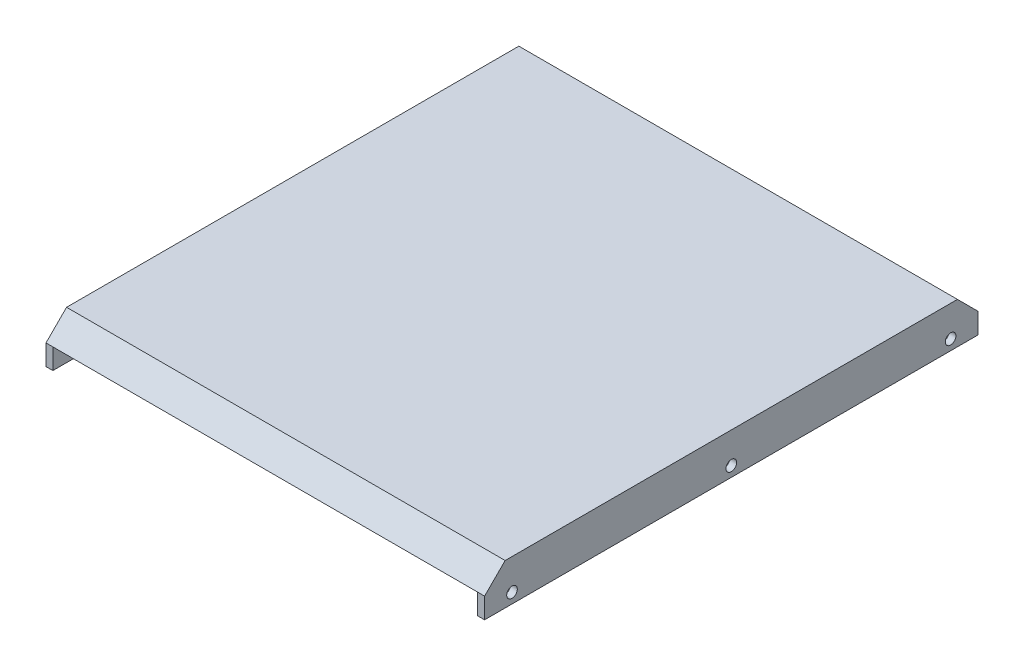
ISO-10303-21;
HEADER;
FILE_DESCRIPTION(('STEP AP214'),'2;1');
FILE_NAME('part.step','',(''),(''),'','','');
FILE_SCHEMA(('AUTOMOTIVE_DESIGN { 1 0 10303 214 1 1 1 1 }'));
ENDSEC;
DATA;
#1=APPLICATION_CONTEXT('core data for automotive mechanical design processes');
#2=APPLICATION_PROTOCOL_DEFINITION('international standard','automotive_design',2000,#1);
#3=PRODUCT_CONTEXT('',#1,'mechanical');
#4=PRODUCT('Part','Part','',(#3));
#5=PRODUCT_RELATED_PRODUCT_CATEGORY('part','',(#4));
#6=PRODUCT_DEFINITION_FORMATION('','',#4);
#7=PRODUCT_DEFINITION_CONTEXT('part definition',#1,'design');
#8=PRODUCT_DEFINITION('design','',#6,#7);
#9=PRODUCT_DEFINITION_SHAPE('','',#8);
#10=(LENGTH_UNIT() NAMED_UNIT(*) SI_UNIT(.MILLI.,.METRE.));
#11=(NAMED_UNIT(*) PLANE_ANGLE_UNIT() SI_UNIT($,.RADIAN.));
#12=(NAMED_UNIT(*) SI_UNIT($,.STERADIAN.) SOLID_ANGLE_UNIT());
#13=UNCERTAINTY_MEASURE_WITH_UNIT(LENGTH_MEASURE(1.E-05),#10,'distance_accuracy_value','');
#14=(GEOMETRIC_REPRESENTATION_CONTEXT(3) GLOBAL_UNCERTAINTY_ASSIGNED_CONTEXT((#13)) GLOBAL_UNIT_ASSIGNED_CONTEXT((#10,
#11,#12)) REPRESENTATION_CONTEXT('',''));
#15=CARTESIAN_POINT('',(0.,0.,0.));
#16=DIRECTION('',(0.,0.,1.));
#17=DIRECTION('',(1.,0.,0.));
#18=AXIS2_PLACEMENT_3D('',#15,#16,#17);
#19=CARTESIAN_POINT('',(0.,0.,-114.3));
#20=DIRECTION('',(0.,0.,1.));
#21=DIRECTION('',(1.,0.,0.));
#22=AXIS2_PLACEMENT_3D('',#19,#20,#21);
#23=PLANE('',#22);
#24=DIRECTION('',(0.,-1.,0.));
#25=VECTOR('',#24,1.);
#26=CARTESIAN_POINT('',(-101.6,9.525,-114.3));
#27=LINE('',#26,#25);
#28=CARTESIAN_POINT('',(-101.6,0.,-114.3));
#29=VERTEX_POINT('',#28);
#30=CARTESIAN_POINT('',(-101.6,-9.525,-114.3));
#31=VERTEX_POINT('',#30);
#32=EDGE_CURVE('E146',#29,#31,#27,.T.);
#33=ORIENTED_EDGE('',*,*,#32,.F.);
#34=DIRECTION('',(1.,0.,0.));
#35=VECTOR('',#34,1.);
#36=CARTESIAN_POINT('',(0.,0.,-114.3));
#37=LINE('',#36,#35);
#38=CARTESIAN_POINT('',(-98.425,0.,-114.3));
#39=VERTEX_POINT('',#38);
#40=EDGE_CURVE('E11',#29,#39,#37,.T.);
#41=ORIENTED_EDGE('',*,*,#40,.T.);
#42=DIRECTION('',(0.,-1.,0.));
#43=VECTOR('',#42,1.);
#44=CARTESIAN_POINT('',(-98.425,-9.525,-114.3));
#45=LINE('',#44,#43);
#46=CARTESIAN_POINT('',(-98.425,-9.525,-114.3));
#47=VERTEX_POINT('',#46);
#48=EDGE_CURVE('E116',#39,#47,#45,.T.);
#49=ORIENTED_EDGE('',*,*,#48,.T.);
#50=DIRECTION('',(1.,0.,0.));
#51=VECTOR('',#50,1.);
#52=CARTESIAN_POINT('',(-101.6,-9.525,-114.3));
#53=LINE('',#52,#51);
#54=EDGE_CURVE('E130',#31,#47,#53,.T.);
#55=ORIENTED_EDGE('',*,*,#54,.F.);
#56=EDGE_LOOP('',(#33,#41,#49,#55));
#57=FACE_BOUND('',#56,.T.);
#58=ADVANCED_FACE('F35',(#57),#23,.F.);
#59=CARTESIAN_POINT('',(0.,0.,114.3));
#60=DIRECTION('',(0.,0.,1.));
#61=DIRECTION('',(1.,0.,0.));
#62=AXIS2_PLACEMENT_3D('',#59,#60,#61);
#63=PLANE('',#62);
#64=DIRECTION('',(0.,1.,0.));
#65=VECTOR('',#64,1.);
#66=CARTESIAN_POINT('',(101.6,9.525,114.3));
#67=LINE('',#66,#65);
#68=CARTESIAN_POINT('',(101.6,-9.525,114.3));
#69=VERTEX_POINT('',#68);
#70=CARTESIAN_POINT('',(101.6,0.,114.3));
#71=VERTEX_POINT('',#70);
#72=EDGE_CURVE('E140',#69,#71,#67,.T.);
#73=ORIENTED_EDGE('',*,*,#72,.T.);
#74=DIRECTION('',(-1.,0.,0.));
#75=VECTOR('',#74,1.);
#76=CARTESIAN_POINT('',(-101.6,0.,114.3));
#77=LINE('',#76,#75);
#78=CARTESIAN_POINT('',(98.425,0.,114.3));
#79=VERTEX_POINT('',#78);
#80=EDGE_CURVE('E167',#71,#79,#77,.T.);
#81=ORIENTED_EDGE('',*,*,#80,.T.);
#82=DIRECTION('',(0.,1.,0.));
#83=VECTOR('',#82,1.);
#84=CARTESIAN_POINT('',(98.425,-9.525,114.3));
#85=LINE('',#84,#83);
#86=CARTESIAN_POINT('',(98.425,-9.525,114.3));
#87=VERTEX_POINT('',#86);
#88=EDGE_CURVE('E199',#87,#79,#85,.T.);
#89=ORIENTED_EDGE('',*,*,#88,.F.);
#90=DIRECTION('',(1.,0.,0.));
#91=VECTOR('',#90,1.);
#92=CARTESIAN_POINT('',(-101.6,-9.525,114.3));
#93=LINE('',#92,#91);
#94=EDGE_CURVE('E192',#87,#69,#93,.T.);
#95=ORIENTED_EDGE('',*,*,#94,.T.);
#96=EDGE_LOOP('',(#73,#81,#89,#95));
#97=FACE_BOUND('',#96,.T.);
#98=ADVANCED_FACE('F188',(#97),#63,.T.);
#99=CARTESIAN_POINT('',(-101.6,-9.525,114.3));
#100=DIRECTION('',(0.,1.,0.));
#101=DIRECTION('',(0.,0.,1.));
#102=AXIS2_PLACEMENT_3D('',#99,#100,#101);
#103=PLANE('',#102);
#104=ORIENTED_EDGE('',*,*,#54,.T.);
#105=DIRECTION('',(0.,0.,1.));
#106=VECTOR('',#105,1.);
#107=CARTESIAN_POINT('',(-98.425,-9.525,-114.3));
#108=LINE('',#107,#106);
#109=CARTESIAN_POINT('',(-98.425,-9.525,114.3));
#110=VERTEX_POINT('',#109);
#111=EDGE_CURVE('E113',#47,#110,#108,.T.);
#112=ORIENTED_EDGE('',*,*,#111,.T.);
#113=CARTESIAN_POINT('',(-101.6,-9.525,114.3));
#114=VERTEX_POINT('',#113);
#115=EDGE_CURVE('E153',#114,#110,#93,.T.);
#116=ORIENTED_EDGE('',*,*,#115,.F.);
#117=DIRECTION('',(0.,0.,-1.));
#118=VECTOR('',#117,1.);
#119=CARTESIAN_POINT('',(-101.6,-9.525,114.3));
#120=LINE('',#119,#118);
#121=EDGE_CURVE('E139',#114,#31,#120,.T.);
#122=ORIENTED_EDGE('',*,*,#121,.T.);
#123=EDGE_LOOP('',(#104,#112,#116,#122));
#124=FACE_BOUND('',#123,.T.);
#125=ADVANCED_FACE('F137',(#124),#103,.F.);
#126=CARTESIAN_POINT('',(101.6,9.525,114.3));
#127=DIRECTION('',(-1.,0.,0.));
#128=DIRECTION('',(0.,0.,1.));
#129=AXIS2_PLACEMENT_3D('',#126,#127,#128);
#130=PLANE('',#129);
#131=CARTESIAN_POINT('',(101.6,-4.76249999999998,-101.6));
#132=DIRECTION('',(-1.,0.,0.));
#133=DIRECTION('',(0.,0.,1.));
#134=AXIS2_PLACEMENT_3D('',#131,#132,#133);
#135=CIRCLE('',#134,2.45744999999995);
#136=CARTESIAN_POINT('',(101.6,-4.76249999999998,-99.1425500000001));
#137=VERTEX_POINT('',#136);
#138=EDGE_CURVE('E248',#137,#137,#135,.T.);
#139=ORIENTED_EDGE('',*,*,#138,.T.);
#140=EDGE_LOOP('',(#139));
#141=FACE_BOUND('',#140,.T.);
#142=CARTESIAN_POINT('',(101.6,-4.76249999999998,0.));
#143=DIRECTION('',(-1.,0.,0.));
#144=DIRECTION('',(0.,0.,1.));
#145=AXIS2_PLACEMENT_3D('',#142,#143,#144);
#146=CIRCLE('',#145,2.45744999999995);
#147=CARTESIAN_POINT('',(101.6,-4.76249999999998,2.45744999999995));
#148=VERTEX_POINT('',#147);
#149=EDGE_CURVE('E165',#148,#148,#146,.T.);
#150=ORIENTED_EDGE('',*,*,#149,.T.);
#151=EDGE_LOOP('',(#150));
#152=FACE_BOUND('',#151,.T.);
#153=CARTESIAN_POINT('',(101.6,-4.76249999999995,101.6));
#154=DIRECTION('',(-1.,0.,0.));
#155=DIRECTION('',(0.,0.,1.));
#156=AXIS2_PLACEMENT_3D('',#153,#154,#155);
#157=CIRCLE('',#156,2.45744999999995);
#158=CARTESIAN_POINT('',(101.6,-4.76249999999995,104.05745));
#159=VERTEX_POINT('',#158);
#160=EDGE_CURVE('E227',#159,#159,#157,.T.);
#161=ORIENTED_EDGE('',*,*,#160,.T.);
#162=EDGE_LOOP('',(#161));
#163=FACE_BOUND('',#162,.T.);
#164=DIRECTION('',(0.,0.,-1.));
#165=VECTOR('',#164,1.);
#166=CARTESIAN_POINT('',(101.6,9.525,114.3));
#167=LINE('',#166,#165);
#168=CARTESIAN_POINT('',(101.6,9.525,104.775));
#169=VERTEX_POINT('',#168);
#170=CARTESIAN_POINT('',(101.6,9.525,-104.775));
#171=VERTEX_POINT('',#170);
#172=EDGE_CURVE('E158',#169,#171,#167,.T.);
#173=ORIENTED_EDGE('',*,*,#172,.F.);
#174=DIRECTION('',(0.,-0.707106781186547,0.707106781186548));
#175=VECTOR('',#174,1.);
#176=CARTESIAN_POINT('',(101.6,0.,114.3));
#177=LINE('',#176,#175);
#178=EDGE_CURVE('E180',#169,#71,#177,.T.);
#179=ORIENTED_EDGE('',*,*,#178,.T.);
#180=ORIENTED_EDGE('',*,*,#72,.F.);
#181=DIRECTION('',(0.,0.,-1.));
#182=VECTOR('',#181,1.);
#183=CARTESIAN_POINT('',(101.6,-9.525,114.3));
#184=LINE('',#183,#182);
#185=CARTESIAN_POINT('',(101.6,-9.525,-114.3));
#186=VERTEX_POINT('',#185);
#187=EDGE_CURVE('E150',#69,#186,#184,.T.);
#188=ORIENTED_EDGE('',*,*,#187,.T.);
#189=DIRECTION('',(0.,1.,0.));
#190=VECTOR('',#189,1.);
#191=CARTESIAN_POINT('',(101.6,9.525,-114.3));
#192=LINE('',#191,#190);
#193=CARTESIAN_POINT('',(101.6,0.,-114.3));
#194=VERTEX_POINT('',#193);
#195=EDGE_CURVE('E207',#186,#194,#192,.T.);
#196=ORIENTED_EDGE('',*,*,#195,.T.);
#197=DIRECTION('',(0.,-0.707106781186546,-0.707106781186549));
#198=VECTOR('',#197,1.);
#199=CARTESIAN_POINT('',(101.6,9.525,-104.775));
#200=LINE('',#199,#198);
#201=EDGE_CURVE('E56',#194,#171,#200,.F.);
#202=ORIENTED_EDGE('',*,*,#201,.T.);
#203=EDGE_LOOP('',(#173,#179,#180,#188,#196,#202));
#204=FACE_BOUND('',#203,.T.);
#205=ADVANCED_FACE('F183',(#141,#152,#163,#204),#130,.F.);
#206=CARTESIAN_POINT('',(-101.6,9.525,114.3));
#207=DIRECTION('',(0.,-1.,0.));
#208=DIRECTION('',(0.,0.,-1.));
#209=AXIS2_PLACEMENT_3D('',#206,#207,#208);
#210=PLANE('',#209);
#211=DIRECTION('',(0.,0.,-1.));
#212=VECTOR('',#211,1.);
#213=CARTESIAN_POINT('',(-101.6,9.525,114.3));
#214=LINE('',#213,#212);
#215=CARTESIAN_POINT('',(-101.6,9.525,104.775));
#216=VERTEX_POINT('',#215);
#217=CARTESIAN_POINT('',(-101.6,9.525,-104.775));
#218=VERTEX_POINT('',#217);
#219=EDGE_CURVE('E155',#216,#218,#214,.T.);
#220=ORIENTED_EDGE('',*,*,#219,.F.);
#221=DIRECTION('',(1.,0.,0.));
#222=VECTOR('',#221,1.);
#223=CARTESIAN_POINT('',(101.6,9.525,104.775));
#224=LINE('',#223,#222);
#225=EDGE_CURVE('E177',#216,#169,#224,.T.);
#226=ORIENTED_EDGE('',*,*,#225,.T.);
#227=ORIENTED_EDGE('',*,*,#172,.T.);
#228=DIRECTION('',(-1.,0.,0.));
#229=VECTOR('',#228,1.);
#230=CARTESIAN_POINT('',(-101.6,9.525,-104.775));
#231=LINE('',#230,#229);
#232=EDGE_CURVE('E174',#171,#218,#231,.T.);
#233=ORIENTED_EDGE('',*,*,#232,.T.);
#234=EDGE_LOOP('',(#220,#226,#227,#233));
#235=FACE_BOUND('',#234,.T.);
#236=ADVANCED_FACE('F261',(#235),#210,.F.);
#237=CARTESIAN_POINT('',(-101.6,9.525,114.3));
#238=DIRECTION('',(1.,0.,0.));
#239=DIRECTION('',(0.,0.,-1.));
#240=AXIS2_PLACEMENT_3D('',#237,#238,#239);
#241=PLANE('',#240);
#242=CARTESIAN_POINT('',(-101.6,-4.76249999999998,-101.6));
#243=DIRECTION('',(-1.,0.,0.));
#244=DIRECTION('',(0.,0.,1.));
#245=AXIS2_PLACEMENT_3D('',#242,#243,#244);
#246=CIRCLE('',#245,2.45744999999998);
#247=CARTESIAN_POINT('',(-101.6,-4.76249999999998,-99.14255));
#248=VERTEX_POINT('',#247);
#249=EDGE_CURVE('E251',#248,#248,#246,.T.);
#250=ORIENTED_EDGE('',*,*,#249,.F.);
#251=EDGE_LOOP('',(#250));
#252=FACE_BOUND('',#251,.T.);
#253=CARTESIAN_POINT('',(-101.6,-4.76249999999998,0.));
#254=DIRECTION('',(-1.,0.,0.));
#255=DIRECTION('',(0.,0.,1.));
#256=AXIS2_PLACEMENT_3D('',#253,#254,#255);
#257=CIRCLE('',#256,2.45744999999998);
#258=CARTESIAN_POINT('',(-101.6,-4.76249999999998,2.45744999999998));
#259=VERTEX_POINT('',#258);
#260=EDGE_CURVE('E239',#259,#259,#257,.T.);
#261=ORIENTED_EDGE('',*,*,#260,.F.);
#262=EDGE_LOOP('',(#261));
#263=FACE_BOUND('',#262,.T.);
#264=CARTESIAN_POINT('',(-101.6,-4.76249999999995,101.6));
#265=DIRECTION('',(-1.,0.,0.));
#266=DIRECTION('',(0.,0.,1.));
#267=AXIS2_PLACEMENT_3D('',#264,#265,#266);
#268=CIRCLE('',#267,2.45744999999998);
#269=CARTESIAN_POINT('',(-101.6,-4.76249999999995,104.05745));
#270=VERTEX_POINT('',#269);
#271=EDGE_CURVE('E232',#270,#270,#268,.T.);
#272=ORIENTED_EDGE('',*,*,#271,.F.);
#273=EDGE_LOOP('',(#272));
#274=FACE_BOUND('',#273,.T.);
#275=DIRECTION('',(0.,-1.,0.));
#276=VECTOR('',#275,1.);
#277=CARTESIAN_POINT('',(-101.6,9.525,114.3));
#278=LINE('',#277,#276);
#279=CARTESIAN_POINT('',(-101.6,0.,114.3));
#280=VERTEX_POINT('',#279);
#281=EDGE_CURVE('E144',#280,#114,#278,.T.);
#282=ORIENTED_EDGE('',*,*,#281,.F.);
#283=DIRECTION('',(0.,0.707106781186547,-0.707106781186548));
#284=VECTOR('',#283,1.);
#285=CARTESIAN_POINT('',(-101.6,0.,114.3));
#286=LINE('',#285,#284);
#287=EDGE_CURVE('E172',#280,#216,#286,.T.);
#288=ORIENTED_EDGE('',*,*,#287,.T.);
#289=ORIENTED_EDGE('',*,*,#219,.T.);
#290=DIRECTION('',(0.,0.707106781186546,0.707106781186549));
#291=VECTOR('',#290,1.);
#292=CARTESIAN_POINT('',(-101.6,9.525,-104.775));
#293=LINE('',#292,#291);
#294=EDGE_CURVE('E170',#218,#29,#293,.F.);
#295=ORIENTED_EDGE('',*,*,#294,.T.);
#296=ORIENTED_EDGE('',*,*,#32,.T.);
#297=ORIENTED_EDGE('',*,*,#121,.F.);
#298=EDGE_LOOP('',(#282,#288,#289,#295,#296,#297));
#299=FACE_BOUND('',#298,.T.);
#300=ADVANCED_FACE('F214',(#252,#263,#274,#299),#241,.F.);
#301=ORIENTED_EDGE('',*,*,#94,.F.);
#302=DIRECTION('',(0.,0.,1.));
#303=VECTOR('',#302,1.);
#304=CARTESIAN_POINT('',(98.425,-9.525,-114.3));
#305=LINE('',#304,#303);
#306=CARTESIAN_POINT('',(98.425,-9.525,-114.3));
#307=VERTEX_POINT('',#306);
#308=EDGE_CURVE('E124',#307,#87,#305,.T.);
#309=ORIENTED_EDGE('',*,*,#308,.F.);
#310=EDGE_CURVE('E141',#307,#186,#53,.T.);
#311=ORIENTED_EDGE('',*,*,#310,.T.);
#312=ORIENTED_EDGE('',*,*,#187,.F.);
#313=EDGE_LOOP('',(#301,#309,#311,#312));
#314=FACE_BOUND('',#313,.T.);
#315=ADVANCED_FACE('F260',(#314),#103,.F.);
#316=DIRECTION('',(0.,-1.,0.));
#317=VECTOR('',#316,1.);
#318=CARTESIAN_POINT('',(-98.425,-9.525,114.3));
#319=LINE('',#318,#317);
#320=CARTESIAN_POINT('',(-98.425,0.,114.3));
#321=VERTEX_POINT('',#320);
#322=EDGE_CURVE('E119',#321,#110,#319,.T.);
#323=ORIENTED_EDGE('',*,*,#322,.F.);
#324=DIRECTION('',(-1.,0.,0.));
#325=VECTOR('',#324,1.);
#326=CARTESIAN_POINT('',(-101.6,0.,114.3));
#327=LINE('',#326,#325);
#328=EDGE_CURVE('E160',#321,#280,#327,.T.);
#329=ORIENTED_EDGE('',*,*,#328,.T.);
#330=ORIENTED_EDGE('',*,*,#281,.T.);
#331=ORIENTED_EDGE('',*,*,#115,.T.);
#332=EDGE_LOOP('',(#323,#329,#330,#331));
#333=FACE_BOUND('',#332,.T.);
#334=ADVANCED_FACE('F290',(#333),#63,.T.);
#335=DIRECTION('',(0.,1.,0.));
#336=VECTOR('',#335,1.);
#337=CARTESIAN_POINT('',(98.425,-9.525,-114.3));
#338=LINE('',#337,#336);
#339=CARTESIAN_POINT('',(98.425,0.,-114.3));
#340=VERTEX_POINT('',#339);
#341=EDGE_CURVE('E133',#307,#340,#338,.T.);
#342=ORIENTED_EDGE('',*,*,#341,.T.);
#343=DIRECTION('',(1.,0.,0.));
#344=VECTOR('',#343,1.);
#345=CARTESIAN_POINT('',(0.,0.,-114.3));
#346=LINE('',#345,#344);
#347=EDGE_CURVE('E43',#340,#194,#346,.T.);
#348=ORIENTED_EDGE('',*,*,#347,.T.);
#349=ORIENTED_EDGE('',*,*,#195,.F.);
#350=ORIENTED_EDGE('',*,*,#310,.F.);
#351=EDGE_LOOP('',(#342,#348,#349,#350));
#352=FACE_BOUND('',#351,.T.);
#353=ADVANCED_FACE('F285',(#352),#23,.F.);
#354=CARTESIAN_POINT('',(-98.425,-9.525,-114.3));
#355=DIRECTION('',(-1.,0.,0.));
#356=DIRECTION('',(0.,0.,1.));
#357=AXIS2_PLACEMENT_3D('',#354,#355,#356);
#358=PLANE('',#357);
#359=CARTESIAN_POINT('',(-98.425,-4.76249999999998,-101.6));
#360=DIRECTION('',(-1.,0.,0.));
#361=DIRECTION('',(0.,0.,1.));
#362=AXIS2_PLACEMENT_3D('',#359,#360,#361);
#363=CIRCLE('',#362,2.45744999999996);
#364=CARTESIAN_POINT('',(-98.425,-4.76249999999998,-99.14255));
#365=VERTEX_POINT('',#364);
#366=EDGE_CURVE('E245',#365,#365,#363,.T.);
#367=ORIENTED_EDGE('',*,*,#366,.T.);
#368=EDGE_LOOP('',(#367));
#369=FACE_BOUND('',#368,.T.);
#370=CARTESIAN_POINT('',(-98.425,-4.76249999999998,0.));
#371=DIRECTION('',(-1.,0.,0.));
#372=DIRECTION('',(0.,0.,1.));
#373=AXIS2_PLACEMENT_3D('',#370,#371,#372);
#374=CIRCLE('',#373,2.45744999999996);
#375=CARTESIAN_POINT('',(-98.425,-4.76249999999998,2.45744999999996));
#376=VERTEX_POINT('',#375);
#377=EDGE_CURVE('E161',#376,#376,#374,.T.);
#378=ORIENTED_EDGE('',*,*,#377,.T.);
#379=EDGE_LOOP('',(#378));
#380=FACE_BOUND('',#379,.T.);
#381=CARTESIAN_POINT('',(-98.425,-4.76249999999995,101.6));
#382=DIRECTION('',(-1.,0.,0.));
#383=DIRECTION('',(0.,0.,1.));
#384=AXIS2_PLACEMENT_3D('',#381,#382,#383);
#385=CIRCLE('',#384,2.45744999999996);
#386=CARTESIAN_POINT('',(-98.425,-4.76249999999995,104.05745));
#387=VERTEX_POINT('',#386);
#388=EDGE_CURVE('E220',#387,#387,#385,.T.);
#389=ORIENTED_EDGE('',*,*,#388,.T.);
#390=EDGE_LOOP('',(#389));
#391=FACE_BOUND('',#390,.T.);
#392=ORIENTED_EDGE('',*,*,#322,.T.);
#393=ORIENTED_EDGE('',*,*,#111,.F.);
#394=ORIENTED_EDGE('',*,*,#48,.F.);
#395=DIRECTION('',(0.,0.,1.));
#396=VECTOR('',#395,1.);
#397=CARTESIAN_POINT('',(-98.425,0.,-114.3));
#398=LINE('',#397,#396);
#399=EDGE_CURVE('E205',#39,#321,#398,.T.);
#400=ORIENTED_EDGE('',*,*,#399,.T.);
#401=EDGE_LOOP('',(#392,#393,#394,#400));
#402=FACE_BOUND('',#401,.T.);
#403=ADVANCED_FACE('F115',(#369,#380,#391,#402),#358,.F.);
#404=CARTESIAN_POINT('',(-98.425,0.,-114.3));
#405=DIRECTION('',(0.,1.,0.));
#406=DIRECTION('',(0.,0.,1.));
#407=AXIS2_PLACEMENT_3D('',#404,#405,#406);
#408=PLANE('',#407);
#409=DIRECTION('',(-1.,0.,0.));
#410=VECTOR('',#409,1.);
#411=CARTESIAN_POINT('',(-98.425,0.,114.3));
#412=LINE('',#411,#410);
#413=EDGE_CURVE('E134',#79,#321,#412,.T.);
#414=ORIENTED_EDGE('',*,*,#413,.T.);
#415=ORIENTED_EDGE('',*,*,#399,.F.);
#416=DIRECTION('',(-1.,0.,0.));
#417=VECTOR('',#416,1.);
#418=CARTESIAN_POINT('',(-98.425,0.,-114.3));
#419=LINE('',#418,#417);
#420=EDGE_CURVE('E125',#340,#39,#419,.T.);
#421=ORIENTED_EDGE('',*,*,#420,.F.);
#422=DIRECTION('',(0.,0.,1.));
#423=VECTOR('',#422,1.);
#424=CARTESIAN_POINT('',(98.425,0.,-114.3));
#425=LINE('',#424,#423);
#426=EDGE_CURVE('E208',#340,#79,#425,.T.);
#427=ORIENTED_EDGE('',*,*,#426,.T.);
#428=EDGE_LOOP('',(#414,#415,#421,#427));
#429=FACE_BOUND('',#428,.T.);
#430=ADVANCED_FACE('F297',(#429),#408,.F.);
#431=CARTESIAN_POINT('',(98.425,-9.525,-114.3));
#432=DIRECTION('',(1.,0.,0.));
#433=DIRECTION('',(0.,0.,-1.));
#434=AXIS2_PLACEMENT_3D('',#431,#432,#433);
#435=PLANE('',#434);
#436=CARTESIAN_POINT('',(98.425,-4.76249999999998,-101.6));
#437=DIRECTION('',(1.,0.,0.));
#438=DIRECTION('',(0.,0.,-1.));
#439=AXIS2_PLACEMENT_3D('',#436,#437,#438);
#440=CIRCLE('',#439,2.45744999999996);
#441=CARTESIAN_POINT('',(98.425,-4.76249999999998,-104.05745));
#442=VERTEX_POINT('',#441);
#443=EDGE_CURVE('E242',#442,#442,#440,.T.);
#444=ORIENTED_EDGE('',*,*,#443,.T.);
#445=EDGE_LOOP('',(#444));
#446=FACE_BOUND('',#445,.T.);
#447=CARTESIAN_POINT('',(98.425,-4.76249999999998,0.));
#448=DIRECTION('',(1.,0.,0.));
#449=DIRECTION('',(0.,0.,-1.));
#450=AXIS2_PLACEMENT_3D('',#447,#448,#449);
#451=CIRCLE('',#450,2.45744999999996);
#452=CARTESIAN_POINT('',(98.425,-4.76249999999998,-2.45744999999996));
#453=VERTEX_POINT('',#452);
#454=EDGE_CURVE('E164',#453,#453,#451,.T.);
#455=ORIENTED_EDGE('',*,*,#454,.T.);
#456=EDGE_LOOP('',(#455));
#457=FACE_BOUND('',#456,.T.);
#458=CARTESIAN_POINT('',(98.425,-4.76249999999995,101.6));
#459=DIRECTION('',(1.,0.,0.));
#460=DIRECTION('',(0.,0.,-1.));
#461=AXIS2_PLACEMENT_3D('',#458,#459,#460);
#462=CIRCLE('',#461,2.45744999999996);
#463=CARTESIAN_POINT('',(98.425,-4.76249999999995,99.14255));
#464=VERTEX_POINT('',#463);
#465=EDGE_CURVE('E222',#464,#464,#462,.T.);
#466=ORIENTED_EDGE('',*,*,#465,.T.);
#467=EDGE_LOOP('',(#466));
#468=FACE_BOUND('',#467,.T.);
#469=ORIENTED_EDGE('',*,*,#88,.T.);
#470=ORIENTED_EDGE('',*,*,#426,.F.);
#471=ORIENTED_EDGE('',*,*,#341,.F.);
#472=ORIENTED_EDGE('',*,*,#308,.T.);
#473=EDGE_LOOP('',(#469,#470,#471,#472));
#474=FACE_BOUND('',#473,.T.);
#475=ADVANCED_FACE('F280',(#446,#457,#468,#474),#435,.F.);
#476=CARTESIAN_POINT('',(-101.6,-4.76249999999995,101.6));
#477=DIRECTION('',(-1.,0.,0.));
#478=DIRECTION('',(0.,0.,1.));
#479=AXIS2_PLACEMENT_3D('',#476,#477,#478);
#480=CYLINDRICAL_SURFACE('',#479,2.45744999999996);
#481=ORIENTED_EDGE('',*,*,#160,.F.);
#482=EDGE_LOOP('',(#481));
#483=FACE_BOUND('',#482,.T.);
#484=ORIENTED_EDGE('',*,*,#465,.F.);
#485=EDGE_LOOP('',(#484));
#486=FACE_BOUND('',#485,.T.);
#487=ADVANCED_FACE('F271',(#483,#486),#480,.F.);
#488=ORIENTED_EDGE('',*,*,#271,.T.);
#489=EDGE_LOOP('',(#488));
#490=FACE_BOUND('',#489,.T.);
#491=ORIENTED_EDGE('',*,*,#388,.F.);
#492=EDGE_LOOP('',(#491));
#493=FACE_BOUND('',#492,.T.);
#494=ADVANCED_FACE('F267',(#490,#493),#480,.F.);
#495=CARTESIAN_POINT('',(-101.6,-4.76249999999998,0.));
#496=DIRECTION('',(-1.,0.,0.));
#497=DIRECTION('',(0.,0.,1.));
#498=AXIS2_PLACEMENT_3D('',#495,#496,#497);
#499=CYLINDRICAL_SURFACE('',#498,2.45744999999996);
#500=ORIENTED_EDGE('',*,*,#260,.T.);
#501=EDGE_LOOP('',(#500));
#502=FACE_BOUND('',#501,.T.);
#503=ORIENTED_EDGE('',*,*,#377,.F.);
#504=EDGE_LOOP('',(#503));
#505=FACE_BOUND('',#504,.T.);
#506=ADVANCED_FACE('F270',(#502,#505),#499,.F.);
#507=ORIENTED_EDGE('',*,*,#149,.F.);
#508=EDGE_LOOP('',(#507));
#509=FACE_BOUND('',#508,.T.);
#510=ORIENTED_EDGE('',*,*,#454,.F.);
#511=EDGE_LOOP('',(#510));
#512=FACE_BOUND('',#511,.T.);
#513=ADVANCED_FACE('F277',(#509,#512),#499,.F.);
#514=CARTESIAN_POINT('',(-101.6,-4.76249999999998,-101.6));
#515=DIRECTION('',(-1.,0.,0.));
#516=DIRECTION('',(0.,0.,1.));
#517=AXIS2_PLACEMENT_3D('',#514,#515,#516);
#518=CYLINDRICAL_SURFACE('',#517,2.45744999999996);
#519=ORIENTED_EDGE('',*,*,#249,.T.);
#520=EDGE_LOOP('',(#519));
#521=FACE_BOUND('',#520,.T.);
#522=ORIENTED_EDGE('',*,*,#366,.F.);
#523=EDGE_LOOP('',(#522));
#524=FACE_BOUND('',#523,.T.);
#525=ADVANCED_FACE('F255',(#521,#524),#518,.F.);
#526=ORIENTED_EDGE('',*,*,#138,.F.);
#527=EDGE_LOOP('',(#526));
#528=FACE_BOUND('',#527,.T.);
#529=ORIENTED_EDGE('',*,*,#443,.F.);
#530=EDGE_LOOP('',(#529));
#531=FACE_BOUND('',#530,.T.);
#532=ADVANCED_FACE('F321',(#528,#531),#518,.F.);
#533=CARTESIAN_POINT('',(0.,0.,114.3));
#534=DIRECTION('',(0.,0.707106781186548,0.707106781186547));
#535=DIRECTION('',(1.,0.,0.));
#536=AXIS2_PLACEMENT_3D('',#533,#534,#535);
#537=PLANE('',#536);
#538=ORIENTED_EDGE('',*,*,#178,.F.);
#539=ORIENTED_EDGE('',*,*,#225,.F.);
#540=ORIENTED_EDGE('',*,*,#287,.F.);
#541=ORIENTED_EDGE('',*,*,#328,.F.);
#542=ORIENTED_EDGE('',*,*,#413,.F.);
#543=ORIENTED_EDGE('',*,*,#80,.F.);
#544=EDGE_LOOP('',(#538,#539,#540,#541,#542,#543));
#545=FACE_BOUND('',#544,.T.);
#546=ADVANCED_FACE('F194',(#545),#537,.T.);
#547=CARTESIAN_POINT('',(-101.6,9.525,-104.775));
#548=DIRECTION('',(0.,-0.707106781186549,0.707106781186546));
#549=DIRECTION('',(-1.,0.,0.));
#550=AXIS2_PLACEMENT_3D('',#547,#548,#549);
#551=PLANE('',#550);
#552=ORIENTED_EDGE('',*,*,#420,.T.);
#553=ORIENTED_EDGE('',*,*,#40,.F.);
#554=ORIENTED_EDGE('',*,*,#294,.F.);
#555=ORIENTED_EDGE('',*,*,#232,.F.);
#556=ORIENTED_EDGE('',*,*,#201,.F.);
#557=ORIENTED_EDGE('',*,*,#347,.F.);
#558=EDGE_LOOP('',(#552,#553,#554,#555,#556,#557));
#559=FACE_BOUND('',#558,.T.);
#560=ADVANCED_FACE('F37',(#559),#551,.F.);
#561=CLOSED_SHELL('',(#58,#98,#125,#205,#236,#300,#315,#334,#353,#403,#430,#475,#487,#494,#506,
#513,#525,#532,#546,#560));
#562=MANIFOLD_SOLID_BREP('B2',#561);
#563=ADVANCED_BREP_SHAPE_REPRESENTATION('',(#18,#562),#14);
#564=SHAPE_DEFINITION_REPRESENTATION(#9,#563);
ENDSEC;
END-ISO-10303-21;
